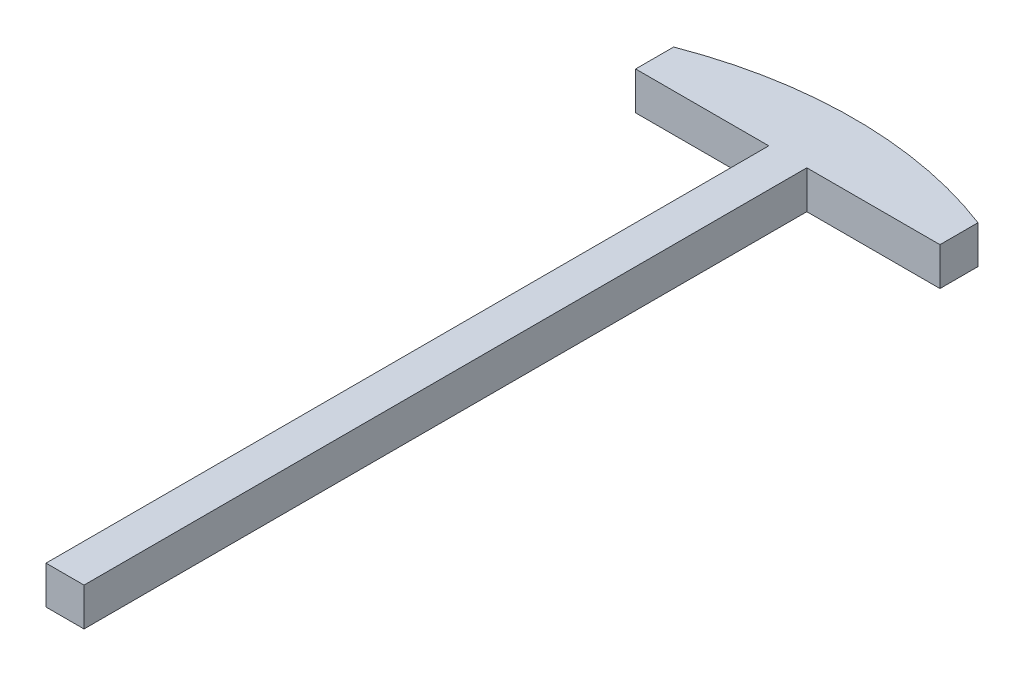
from build123d import *

# Parameters (mm, degrees)
BOSS_EXTRUDE1_DEPTH = 5


with BuildPart() as part:
    # Sketch1 → Boss-Extrude1 (new body)
    with BuildSketch(Plane(origin=(0, 0, 0), x_dir=(1, 0, 0), z_dir=(0, 1, 0))):
        with BuildLine():
            Line((2.318903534, 6.190563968), (19.818903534, 6.190563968))
            Line((19.818903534, 6.190563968), (19.818903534, 11.190563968))
            ThreePointArc((19.818903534, 11.190563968), (-0.181096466, 14.896653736), (-20.181096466, 11.190563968))
            Line((-20.181096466, 11.190563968), (-20.181096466, 6.190563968))
            Line((-20.181096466, 6.190563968), (-2.681096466, 6.190563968))
            Line((-2.681096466, 6.190563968), (-2.681096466, -88.809436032))
            Line((-2.681096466, -88.809436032), (2.318903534, -88.809436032))
            Line((2.318903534, -88.809436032), (2.318903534, 6.190563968))
        make_face()
    extrude(amount=BOSS_EXTRUDE1_DEPTH)


solid = part.part
